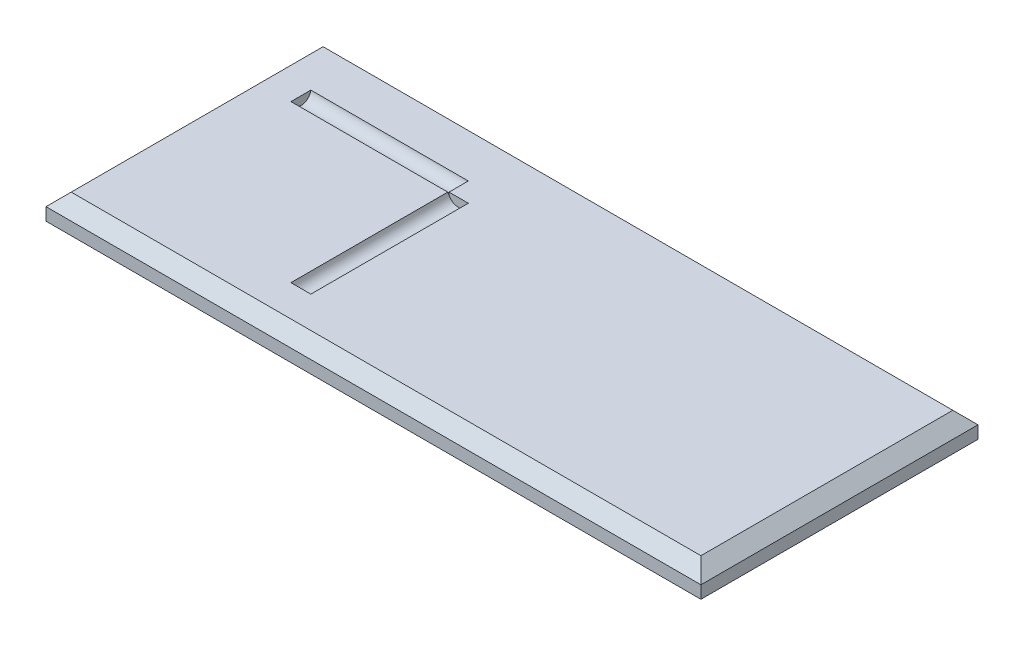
ISO-10303-21;
HEADER;
FILE_DESCRIPTION(('STEP AP214'),'2;1');
FILE_NAME('part.step','',(''),(''),'','','');
FILE_SCHEMA(('AUTOMOTIVE_DESIGN { 1 0 10303 214 1 1 1 1 }'));
ENDSEC;
DATA;
#1=APPLICATION_CONTEXT('core data for automotive mechanical design processes');
#2=APPLICATION_PROTOCOL_DEFINITION('international standard','automotive_design',2000,#1);
#3=PRODUCT_CONTEXT('',#1,'mechanical');
#4=PRODUCT('Part','Part','',(#3));
#5=PRODUCT_RELATED_PRODUCT_CATEGORY('part','',(#4));
#6=PRODUCT_DEFINITION_FORMATION('','',#4);
#7=PRODUCT_DEFINITION_CONTEXT('part definition',#1,'design');
#8=PRODUCT_DEFINITION('design','',#6,#7);
#9=PRODUCT_DEFINITION_SHAPE('','',#8);
#10=(LENGTH_UNIT() NAMED_UNIT(*) SI_UNIT(.MILLI.,.METRE.));
#11=(NAMED_UNIT(*) PLANE_ANGLE_UNIT() SI_UNIT($,.RADIAN.));
#12=(NAMED_UNIT(*) SI_UNIT($,.STERADIAN.) SOLID_ANGLE_UNIT());
#13=UNCERTAINTY_MEASURE_WITH_UNIT(LENGTH_MEASURE(1.E-05),#10,'distance_accuracy_value','');
#14=(GEOMETRIC_REPRESENTATION_CONTEXT(3) GLOBAL_UNCERTAINTY_ASSIGNED_CONTEXT((#13)) GLOBAL_UNIT_ASSIGNED_CONTEXT((#10,
#11,#12)) REPRESENTATION_CONTEXT('',''));
#15=CARTESIAN_POINT('',(0.,0.,0.));
#16=DIRECTION('',(0.,0.,1.));
#17=DIRECTION('',(1.,0.,0.));
#18=AXIS2_PLACEMENT_3D('',#15,#16,#17);
#19=CARTESIAN_POINT('',(330.2,12.7,-139.7));
#20=DIRECTION('',(0.,1.,0.));
#21=DIRECTION('',(-1.,0.,0.));
#22=AXIS2_PLACEMENT_3D('',#19,#20,#21);
#23=PLANE('',#22);
#24=DIRECTION('',(-1.,0.,0.));
#25=VECTOR('',#24,1.);
#26=CARTESIAN_POINT('',(330.2,12.7,-133.35));
#27=LINE('',#26,#25);
#28=CARTESIAN_POINT('',(323.85,12.7,-133.35));
#29=VERTEX_POINT('',#28);
#30=CARTESIAN_POINT('',(6.35000000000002,12.7,-133.35));
#31=VERTEX_POINT('',#30);
#32=EDGE_CURVE('E178',#29,#31,#27,.T.);
#33=ORIENTED_EDGE('',*,*,#32,.T.);
#34=DIRECTION('',(0.,0.,1.));
#35=VECTOR('',#34,1.);
#36=CARTESIAN_POINT('',(6.35000000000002,12.7,0.));
#37=LINE('',#36,#35);
#38=CARTESIAN_POINT('',(6.35000000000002,12.7,-6.35000000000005));
#39=VERTEX_POINT('',#38);
#40=EDGE_CURVE('E180',#31,#39,#37,.T.);
#41=ORIENTED_EDGE('',*,*,#40,.T.);
#42=DIRECTION('',(1.,0.,0.));
#43=VECTOR('',#42,1.);
#44=CARTESIAN_POINT('',(330.2,12.7,-6.35000000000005));
#45=LINE('',#44,#43);
#46=CARTESIAN_POINT('',(323.85,12.7,-6.35000000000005));
#47=VERTEX_POINT('',#46);
#48=EDGE_CURVE('E174',#39,#47,#45,.T.);
#49=ORIENTED_EDGE('',*,*,#48,.T.);
#50=DIRECTION('',(0.,0.,-1.));
#51=VECTOR('',#50,1.);
#52=CARTESIAN_POINT('',(323.85,12.7,-139.7));
#53=LINE('',#52,#51);
#54=EDGE_CURVE('E176',#47,#29,#53,.T.);
#55=ORIENTED_EDGE('',*,*,#54,.T.);
#56=EDGE_LOOP('',(#33,#41,#49,#55));
#57=FACE_BOUND('',#56,.T.);
#58=DIRECTION('',(-1.,0.,0.));
#59=VECTOR('',#58,1.);
#60=CARTESIAN_POINT('',(101.6,12.7,-111.313493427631));
#61=LINE('',#60,#59);
#62=CARTESIAN_POINT('',(101.6,12.7,-111.313493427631));
#63=VERTEX_POINT('',#62);
#64=CARTESIAN_POINT('',(22.225,12.7,-111.313493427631));
#65=VERTEX_POINT('',#64);
#66=EDGE_CURVE('E114',#63,#65,#61,.T.);
#67=ORIENTED_EDGE('',*,*,#66,.F.);
#68=DIRECTION('',(0.,0.,-1.));
#69=VECTOR('',#68,1.);
#70=CARTESIAN_POINT('',(101.6,12.7,-111.313493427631));
#71=LINE('',#70,#69);
#72=CARTESIAN_POINT('',(101.6,12.7,-101.6));
#73=VERTEX_POINT('',#72);
#74=EDGE_CURVE('E123',#73,#63,#71,.T.);
#75=ORIENTED_EDGE('',*,*,#74,.F.);
#76=DIRECTION('',(-1.,0.,0.));
#77=VECTOR('',#76,1.);
#78=CARTESIAN_POINT('',(111.313493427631,12.7,-101.6));
#79=LINE('',#78,#77);
#80=CARTESIAN_POINT('',(111.313493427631,12.7,-101.6));
#81=VERTEX_POINT('',#80);
#82=EDGE_CURVE('E136',#81,#73,#79,.T.);
#83=ORIENTED_EDGE('',*,*,#82,.F.);
#84=DIRECTION('',(0.,0.,1.));
#85=VECTOR('',#84,1.);
#86=CARTESIAN_POINT('',(111.313493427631,12.7,-101.6));
#87=LINE('',#86,#85);
#88=CARTESIAN_POINT('',(111.313493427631,12.7,-22.225));
#89=VERTEX_POINT('',#88);
#90=EDGE_CURVE('E139',#81,#89,#87,.T.);
#91=ORIENTED_EDGE('',*,*,#90,.T.);
#92=DIRECTION('',(-1.,0.,0.));
#93=VECTOR('',#92,1.);
#94=CARTESIAN_POINT('',(111.313493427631,12.7,-22.225));
#95=LINE('',#94,#93);
#96=CARTESIAN_POINT('',(101.278283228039,12.7,-22.225));
#97=VERTEX_POINT('',#96);
#98=EDGE_CURVE('E132',#89,#97,#95,.T.);
#99=ORIENTED_EDGE('',*,*,#98,.T.);
#100=DIRECTION('',(0.,0.,1.));
#101=VECTOR('',#100,1.);
#102=CARTESIAN_POINT('',(101.278283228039,12.7,-101.6));
#103=LINE('',#102,#101);
#104=CARTESIAN_POINT('',(101.278283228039,12.7,-101.278283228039));
#105=VERTEX_POINT('',#104);
#106=EDGE_CURVE('E51',#105,#97,#103,.T.);
#107=ORIENTED_EDGE('',*,*,#106,.F.);
#108=DIRECTION('',(-1.,0.,0.));
#109=VECTOR('',#108,1.);
#110=CARTESIAN_POINT('',(101.6,12.7,-101.278283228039));
#111=LINE('',#110,#109);
#112=CARTESIAN_POINT('',(22.225,12.7,-101.278283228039));
#113=VERTEX_POINT('',#112);
#114=EDGE_CURVE('E112',#105,#113,#111,.T.);
#115=ORIENTED_EDGE('',*,*,#114,.T.);
#116=DIRECTION('',(0.,0.,-1.));
#117=VECTOR('',#116,1.);
#118=CARTESIAN_POINT('',(22.225,12.7,-111.313493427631));
#119=LINE('',#118,#117);
#120=EDGE_CURVE('E117',#113,#65,#119,.T.);
#121=ORIENTED_EDGE('',*,*,#120,.T.);
#122=EDGE_LOOP('',(#67,#75,#83,#91,#99,#107,#115,#121));
#123=FACE_BOUND('',#122,.T.);
#124=ADVANCED_FACE('F28',(#57,#123),#23,.T.);
#125=CARTESIAN_POINT('',(106.295888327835,13.49375,-101.6));
#126=DIRECTION('',(0.,0.,1.));
#127=DIRECTION('',(1.,0.,0.));
#128=AXIS2_PLACEMENT_3D('',#125,#126,#127);
#129=PLANE('',#128);
#130=ORIENTED_EDGE('',*,*,#82,.T.);
#131=DIRECTION('',(0.,-1.,0.));
#132=VECTOR('',#131,1.);
#133=CARTESIAN_POINT('',(101.6,13.49375,-101.6));
#134=LINE('',#133,#132);
#135=CARTESIAN_POINT('',(101.6,11.5559592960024,-101.6));
#136=VERTEX_POINT('',#135);
#137=EDGE_CURVE('E11',#73,#136,#134,.T.);
#138=ORIENTED_EDGE('',*,*,#137,.T.);
#139=CARTESIAN_POINT('',(106.295888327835,13.49375,-101.6));
#140=DIRECTION('',(0.,0.,1.));
#141=DIRECTION('',(1.,0.,0.));
#142=AXIS2_PLACEMENT_3D('',#139,#140,#141);
#143=CIRCLE('',#142,5.08);
#144=EDGE_CURVE('E134',#136,#81,#143,.T.);
#145=ORIENTED_EDGE('',*,*,#144,.T.);
#146=EDGE_LOOP('',(#130,#138,#145));
#147=FACE_BOUND('',#146,.T.);
#148=ADVANCED_FACE('F233',(#147),#129,.T.);
#149=CARTESIAN_POINT('',(0.,0.,-139.7));
#150=DIRECTION('',(1.,0.,0.));
#151=DIRECTION('',(0.,0.,-1.));
#152=AXIS2_PLACEMENT_3D('',#149,#150,#151);
#153=PLANE('',#152);
#154=DIRECTION('',(0.,1.,0.));
#155=VECTOR('',#154,1.);
#156=CARTESIAN_POINT('',(0.,0.,0.));
#157=LINE('',#156,#155);
#158=CARTESIAN_POINT('',(0.,0.,0.));
#159=VERTEX_POINT('',#158);
#160=CARTESIAN_POINT('',(0.,6.34999999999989,0.));
#161=VERTEX_POINT('',#160);
#162=EDGE_CURVE('E153',#159,#161,#157,.T.);
#163=ORIENTED_EDGE('',*,*,#162,.T.);
#164=DIRECTION('',(0.,0.,-1.));
#165=VECTOR('',#164,1.);
#166=CARTESIAN_POINT('',(0.,6.34999999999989,-139.7));
#167=LINE('',#166,#165);
#168=CARTESIAN_POINT('',(0.,6.34999999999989,-139.7));
#169=VERTEX_POINT('',#168);
#170=EDGE_CURVE('E183',#161,#169,#167,.T.);
#171=ORIENTED_EDGE('',*,*,#170,.T.);
#172=DIRECTION('',(0.,1.,0.));
#173=VECTOR('',#172,1.);
#174=CARTESIAN_POINT('',(0.,0.,-139.7));
#175=LINE('',#174,#173);
#176=CARTESIAN_POINT('',(0.,0.,-139.7));
#177=VERTEX_POINT('',#176);
#178=EDGE_CURVE('E161',#177,#169,#175,.T.);
#179=ORIENTED_EDGE('',*,*,#178,.F.);
#180=DIRECTION('',(0.,0.,1.));
#181=VECTOR('',#180,1.);
#182=CARTESIAN_POINT('',(0.,0.,-139.7));
#183=LINE('',#182,#181);
#184=EDGE_CURVE('E169',#177,#159,#183,.T.);
#185=ORIENTED_EDGE('',*,*,#184,.T.);
#186=EDGE_LOOP('',(#163,#171,#179,#185));
#187=FACE_BOUND('',#186,.T.);
#188=ADVANCED_FACE('F30',(#187),#153,.F.);
#189=CARTESIAN_POINT('',(330.2,12.7,-139.7));
#190=DIRECTION('',(-1.,0.,0.));
#191=DIRECTION('',(0.,0.,1.));
#192=AXIS2_PLACEMENT_3D('',#189,#190,#191);
#193=PLANE('',#192);
#194=DIRECTION('',(0.,-1.,0.));
#195=VECTOR('',#194,1.);
#196=CARTESIAN_POINT('',(330.2,12.7,-139.7));
#197=LINE('',#196,#195);
#198=CARTESIAN_POINT('',(330.2,6.34999999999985,-139.7));
#199=VERTEX_POINT('',#198);
#200=CARTESIAN_POINT('',(330.2,0.,-139.7));
#201=VERTEX_POINT('',#200);
#202=EDGE_CURVE('E164',#199,#201,#197,.T.);
#203=ORIENTED_EDGE('',*,*,#202,.F.);
#204=DIRECTION('',(0.,0.,1.));
#205=VECTOR('',#204,1.);
#206=CARTESIAN_POINT('',(330.2,6.34999999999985,0.));
#207=LINE('',#206,#205);
#208=CARTESIAN_POINT('',(330.2,6.34999999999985,0.));
#209=VERTEX_POINT('',#208);
#210=EDGE_CURVE('E188',#199,#209,#207,.T.);
#211=ORIENTED_EDGE('',*,*,#210,.T.);
#212=DIRECTION('',(0.,-1.,0.));
#213=VECTOR('',#212,1.);
#214=CARTESIAN_POINT('',(330.2,12.7,0.));
#215=LINE('',#214,#213);
#216=CARTESIAN_POINT('',(330.2,0.,0.));
#217=VERTEX_POINT('',#216);
#218=EDGE_CURVE('E156',#209,#217,#215,.T.);
#219=ORIENTED_EDGE('',*,*,#218,.T.);
#220=DIRECTION('',(0.,0.,1.));
#221=VECTOR('',#220,1.);
#222=CARTESIAN_POINT('',(330.2,0.,-139.7));
#223=LINE('',#222,#221);
#224=EDGE_CURVE('E171',#201,#217,#223,.T.);
#225=ORIENTED_EDGE('',*,*,#224,.F.);
#226=EDGE_LOOP('',(#203,#211,#219,#225));
#227=FACE_BOUND('',#226,.T.);
#228=ADVANCED_FACE('F221',(#227),#193,.F.);
#229=CARTESIAN_POINT('',(0.,0.,-139.7));
#230=DIRECTION('',(0.,-1.,0.));
#231=DIRECTION('',(0.,0.,-1.));
#232=AXIS2_PLACEMENT_3D('',#229,#230,#231);
#233=PLANE('',#232);
#234=DIRECTION('',(1.,0.,0.));
#235=VECTOR('',#234,1.);
#236=CARTESIAN_POINT('',(0.,0.,0.));
#237=LINE('',#236,#235);
#238=EDGE_CURVE('E158',#159,#217,#237,.T.);
#239=ORIENTED_EDGE('',*,*,#238,.F.);
#240=ORIENTED_EDGE('',*,*,#184,.F.);
#241=DIRECTION('',(1.,0.,0.));
#242=VECTOR('',#241,1.);
#243=CARTESIAN_POINT('',(0.,0.,-139.7));
#244=LINE('',#243,#242);
#245=EDGE_CURVE('E166',#177,#201,#244,.T.);
#246=ORIENTED_EDGE('',*,*,#245,.T.);
#247=ORIENTED_EDGE('',*,*,#224,.T.);
#248=EDGE_LOOP('',(#239,#240,#246,#247));
#249=FACE_BOUND('',#248,.T.);
#250=ADVANCED_FACE('F243',(#249),#233,.T.);
#251=CARTESIAN_POINT('',(0.,0.,-139.7));
#252=DIRECTION('',(0.,0.,-1.));
#253=DIRECTION('',(-1.,0.,0.));
#254=AXIS2_PLACEMENT_3D('',#251,#252,#253);
#255=PLANE('',#254);
#256=ORIENTED_EDGE('',*,*,#178,.T.);
#257=DIRECTION('',(1.,0.,0.));
#258=VECTOR('',#257,1.);
#259=CARTESIAN_POINT('',(0.,6.34999999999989,-139.7));
#260=LINE('',#259,#258);
#261=EDGE_CURVE('E186',#169,#199,#260,.T.);
#262=ORIENTED_EDGE('',*,*,#261,.T.);
#263=ORIENTED_EDGE('',*,*,#202,.T.);
#264=ORIENTED_EDGE('',*,*,#245,.F.);
#265=EDGE_LOOP('',(#256,#262,#263,#264));
#266=FACE_BOUND('',#265,.T.);
#267=ADVANCED_FACE('F216',(#266),#255,.T.);
#268=CARTESIAN_POINT('',(0.,0.,0.));
#269=DIRECTION('',(0.,0.,-1.));
#270=DIRECTION('',(-1.,0.,0.));
#271=AXIS2_PLACEMENT_3D('',#268,#269,#270);
#272=PLANE('',#271);
#273=ORIENTED_EDGE('',*,*,#218,.F.);
#274=DIRECTION('',(-1.,0.,0.));
#275=VECTOR('',#274,1.);
#276=CARTESIAN_POINT('',(0.,6.34999999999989,0.));
#277=LINE('',#276,#275);
#278=EDGE_CURVE('E36',#209,#161,#277,.T.);
#279=ORIENTED_EDGE('',*,*,#278,.T.);
#280=ORIENTED_EDGE('',*,*,#162,.F.);
#281=ORIENTED_EDGE('',*,*,#238,.T.);
#282=EDGE_LOOP('',(#273,#279,#280,#281));
#283=FACE_BOUND('',#282,.T.);
#284=ADVANCED_FACE('F193',(#283),#272,.F.);
#285=CARTESIAN_POINT('',(330.2,6.34999999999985,-139.7));
#286=DIRECTION('',(0.707106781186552,0.707106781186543,0.));
#287=DIRECTION('',(-0.707106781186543,0.707106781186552,0.));
#288=AXIS2_PLACEMENT_3D('',#285,#286,#287);
#289=PLANE('',#288);
#290=DIRECTION('',(-0.577350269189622,0.57735026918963,-0.577350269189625));
#291=VECTOR('',#290,1.);
#292=CARTESIAN_POINT('',(220.133333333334,116.416666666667,-110.066666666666));
#293=LINE('',#292,#291);
#294=EDGE_CURVE('E147',#209,#47,#293,.T.);
#295=ORIENTED_EDGE('',*,*,#294,.F.);
#296=ORIENTED_EDGE('',*,*,#210,.F.);
#297=DIRECTION('',(0.577350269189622,-0.57735026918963,-0.577350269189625));
#298=VECTOR('',#297,1.);
#299=CARTESIAN_POINT('',(330.2,6.34999999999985,-139.7));
#300=LINE('',#299,#298);
#301=EDGE_CURVE('E150',#29,#199,#300,.T.);
#302=ORIENTED_EDGE('',*,*,#301,.F.);
#303=ORIENTED_EDGE('',*,*,#54,.F.);
#304=EDGE_LOOP('',(#295,#296,#302,#303));
#305=FACE_BOUND('',#304,.T.);
#306=ADVANCED_FACE('F223',(#305),#289,.T.);
#307=CARTESIAN_POINT('',(330.2,12.7,-133.35));
#308=DIRECTION('',(0.,-0.707106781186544,0.707106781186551));
#309=DIRECTION('',(0.,-0.707106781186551,-0.707106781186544));
#310=AXIS2_PLACEMENT_3D('',#307,#308,#309);
#311=PLANE('',#310);
#312=ORIENTED_EDGE('',*,*,#301,.T.);
#313=ORIENTED_EDGE('',*,*,#261,.F.);
#314=DIRECTION('',(-0.577350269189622,-0.57735026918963,-0.577350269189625));
#315=VECTOR('',#314,1.);
#316=CARTESIAN_POINT('',(114.299999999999,120.65,-25.4000000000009));
#317=LINE('',#316,#315);
#318=EDGE_CURVE('E145',#31,#169,#317,.T.);
#319=ORIENTED_EDGE('',*,*,#318,.F.);
#320=ORIENTED_EDGE('',*,*,#32,.F.);
#321=EDGE_LOOP('',(#312,#313,#319,#320));
#322=FACE_BOUND('',#321,.T.);
#323=ADVANCED_FACE('F213',(#322),#311,.F.);
#324=CARTESIAN_POINT('',(0.,6.34999999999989,0.));
#325=DIRECTION('',(0.,0.707106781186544,0.707106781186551));
#326=DIRECTION('',(0.,-0.707106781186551,0.707106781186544));
#327=AXIS2_PLACEMENT_3D('',#324,#325,#326);
#328=PLANE('',#327);
#329=ORIENTED_EDGE('',*,*,#294,.T.);
#330=ORIENTED_EDGE('',*,*,#48,.F.);
#331=DIRECTION('',(-0.577350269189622,-0.57735026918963,0.577350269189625));
#332=VECTOR('',#331,1.);
#333=CARTESIAN_POINT('',(0.,6.34999999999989,0.));
#334=LINE('',#333,#332);
#335=EDGE_CURVE('E141',#161,#39,#334,.F.);
#336=ORIENTED_EDGE('',*,*,#335,.F.);
#337=ORIENTED_EDGE('',*,*,#278,.F.);
#338=EDGE_LOOP('',(#329,#330,#336,#337));
#339=FACE_BOUND('',#338,.T.);
#340=ADVANCED_FACE('F207',(#339),#328,.T.);
#341=CARTESIAN_POINT('',(6.35000000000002,12.7,-139.7));
#342=DIRECTION('',(-0.707106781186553,0.707106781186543,0.));
#343=DIRECTION('',(-0.707106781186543,-0.707106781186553,0.));
#344=AXIS2_PLACEMENT_3D('',#341,#342,#343);
#345=PLANE('',#344);
#346=ORIENTED_EDGE('',*,*,#318,.T.);
#347=ORIENTED_EDGE('',*,*,#170,.F.);
#348=ORIENTED_EDGE('',*,*,#335,.T.);
#349=ORIENTED_EDGE('',*,*,#40,.F.);
#350=EDGE_LOOP('',(#346,#347,#348,#349));
#351=FACE_BOUND('',#350,.T.);
#352=ADVANCED_FACE('F202',(#351),#345,.T.);
#353=CARTESIAN_POINT('',(106.295888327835,13.49375,-101.6));
#354=DIRECTION('',(0.,0.,1.));
#355=DIRECTION('',(1.,0.,0.));
#356=AXIS2_PLACEMENT_3D('',#353,#354,#355);
#357=CYLINDRICAL_SURFACE('',#356,5.08);
#358=ORIENTED_EDGE('',*,*,#144,.F.);
#359=CARTESIAN_POINT('',(106.295888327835,13.4937500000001,-106.295888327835));
#360=DIRECTION('',(0.707106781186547,0.,0.707106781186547));
#361=DIRECTION('',(-0.707106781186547,0.,0.707106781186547));
#362=AXIS2_PLACEMENT_3D('',#359,#360,#361);
#363=ELLIPSE('',#362,7.18420489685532,5.08);
#364=EDGE_CURVE('E125',#136,#105,#363,.F.);
#365=ORIENTED_EDGE('',*,*,#364,.T.);
#366=ORIENTED_EDGE('',*,*,#106,.T.);
#367=CARTESIAN_POINT('',(106.295888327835,13.49375,-22.225));
#368=DIRECTION('',(0.,0.,1.));
#369=DIRECTION('',(1.,0.,0.));
#370=AXIS2_PLACEMENT_3D('',#367,#368,#369);
#371=CIRCLE('',#370,5.08);
#372=EDGE_CURVE('E130',#97,#89,#371,.T.);
#373=ORIENTED_EDGE('',*,*,#372,.T.);
#374=ORIENTED_EDGE('',*,*,#90,.F.);
#375=EDGE_LOOP('',(#358,#365,#366,#373,#374));
#376=FACE_BOUND('',#375,.T.);
#377=ADVANCED_FACE('F277',(#376),#357,.F.);
#378=CARTESIAN_POINT('',(106.295888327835,13.49375,-22.225));
#379=DIRECTION('',(0.,0.,1.));
#380=DIRECTION('',(1.,0.,0.));
#381=AXIS2_PLACEMENT_3D('',#378,#379,#380);
#382=PLANE('',#381);
#383=ORIENTED_EDGE('',*,*,#372,.F.);
#384=ORIENTED_EDGE('',*,*,#98,.F.);
#385=EDGE_LOOP('',(#383,#384));
#386=FACE_BOUND('',#385,.T.);
#387=ADVANCED_FACE('F284',(#386),#382,.F.);
#388=CARTESIAN_POINT('',(101.6,13.4937500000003,-106.295888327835));
#389=DIRECTION('',(-1.,0.,0.));
#390=DIRECTION('',(0.,0.,1.));
#391=AXIS2_PLACEMENT_3D('',#388,#389,#390);
#392=CYLINDRICAL_SURFACE('',#391,5.07999999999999);
#393=CARTESIAN_POINT('',(101.6,13.4937500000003,-106.295888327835));
#394=DIRECTION('',(-1.,0.,0.));
#395=DIRECTION('',(0.,0.,1.));
#396=AXIS2_PLACEMENT_3D('',#393,#394,#395);
#397=CIRCLE('',#396,5.07999999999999);
#398=EDGE_CURVE('E43',#63,#136,#397,.T.);
#399=ORIENTED_EDGE('',*,*,#398,.F.);
#400=ORIENTED_EDGE('',*,*,#66,.T.);
#401=CARTESIAN_POINT('',(22.225,13.4937500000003,-106.295888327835));
#402=DIRECTION('',(-1.,0.,0.));
#403=DIRECTION('',(0.,0.,1.));
#404=AXIS2_PLACEMENT_3D('',#401,#402,#403);
#405=CIRCLE('',#404,5.07999999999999);
#406=EDGE_CURVE('E108',#65,#113,#405,.T.);
#407=ORIENTED_EDGE('',*,*,#406,.T.);
#408=ORIENTED_EDGE('',*,*,#114,.F.);
#409=ORIENTED_EDGE('',*,*,#364,.F.);
#410=EDGE_LOOP('',(#399,#400,#407,#408,#409));
#411=FACE_BOUND('',#410,.T.);
#412=ADVANCED_FACE('F110',(#411),#392,.F.);
#413=CARTESIAN_POINT('',(101.6,13.4937500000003,-106.295888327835));
#414=DIRECTION('',(-1.,0.,0.));
#415=DIRECTION('',(0.,0.,1.));
#416=AXIS2_PLACEMENT_3D('',#413,#414,#415);
#417=PLANE('',#416);
#418=ORIENTED_EDGE('',*,*,#74,.T.);
#419=ORIENTED_EDGE('',*,*,#398,.T.);
#420=ORIENTED_EDGE('',*,*,#137,.F.);
#421=EDGE_LOOP('',(#418,#419,#420));
#422=FACE_BOUND('',#421,.T.);
#423=ADVANCED_FACE('F303',(#422),#417,.T.);
#424=CARTESIAN_POINT('',(22.225,13.4937500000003,-106.295888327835));
#425=DIRECTION('',(-1.,0.,0.));
#426=DIRECTION('',(0.,0.,1.));
#427=AXIS2_PLACEMENT_3D('',#424,#425,#426);
#428=PLANE('',#427);
#429=ORIENTED_EDGE('',*,*,#406,.F.);
#430=ORIENTED_EDGE('',*,*,#120,.F.);
#431=EDGE_LOOP('',(#429,#430));
#432=FACE_BOUND('',#431,.T.);
#433=ADVANCED_FACE('F119',(#432),#428,.F.);
#434=CLOSED_SHELL('',(#124,#148,#188,#228,#250,#267,#284,#306,#323,#340,#352,#377,#387,#412,
#423,#433));
#435=MANIFOLD_SOLID_BREP('B2',#434);
#436=ADVANCED_BREP_SHAPE_REPRESENTATION('',(#18,#435),#14);
#437=SHAPE_DEFINITION_REPRESENTATION(#9,#436);
ENDSEC;
END-ISO-10303-21;
